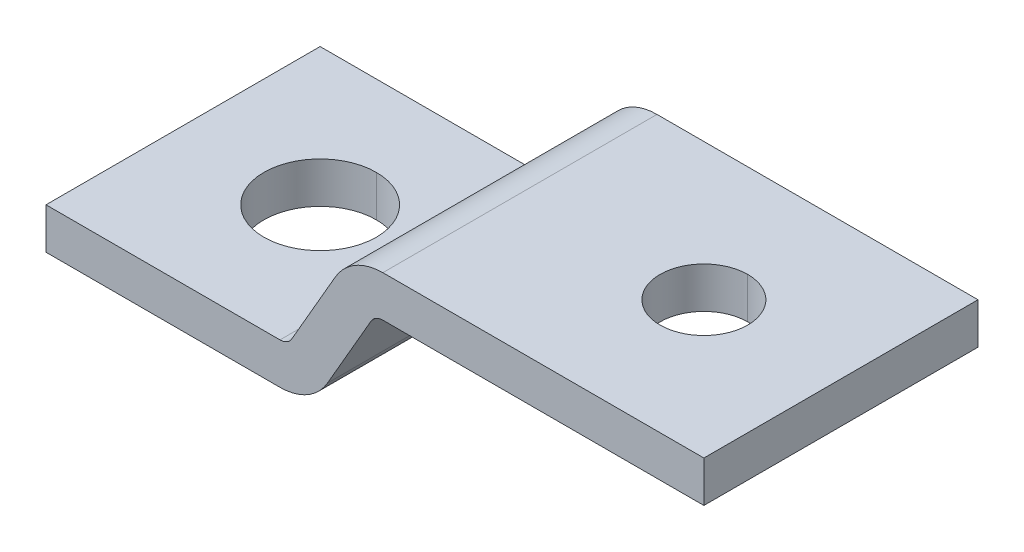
ISO-10303-21;
HEADER;
FILE_DESCRIPTION(('STEP AP214'),'2;1');
FILE_NAME('part.step','',(''),(''),'','','');
FILE_SCHEMA(('AUTOMOTIVE_DESIGN { 1 0 10303 214 1 1 1 1 }'));
ENDSEC;
DATA;
#1=APPLICATION_CONTEXT('core data for automotive mechanical design processes');
#2=APPLICATION_PROTOCOL_DEFINITION('international standard','automotive_design',2000,#1);
#3=PRODUCT_CONTEXT('',#1,'mechanical');
#4=PRODUCT('Part','Part','',(#3));
#5=PRODUCT_RELATED_PRODUCT_CATEGORY('part','',(#4));
#6=PRODUCT_DEFINITION_FORMATION('','',#4);
#7=PRODUCT_DEFINITION_CONTEXT('part definition',#1,'design');
#8=PRODUCT_DEFINITION('design','',#6,#7);
#9=PRODUCT_DEFINITION_SHAPE('','',#8);
#10=(LENGTH_UNIT() NAMED_UNIT(*) SI_UNIT(.MILLI.,.METRE.));
#11=(NAMED_UNIT(*) PLANE_ANGLE_UNIT() SI_UNIT($,.RADIAN.));
#12=(NAMED_UNIT(*) SI_UNIT($,.STERADIAN.) SOLID_ANGLE_UNIT());
#13=UNCERTAINTY_MEASURE_WITH_UNIT(LENGTH_MEASURE(1.E-05),#10,'distance_accuracy_value','');
#14=(GEOMETRIC_REPRESENTATION_CONTEXT(3) GLOBAL_UNCERTAINTY_ASSIGNED_CONTEXT((#13)) GLOBAL_UNIT_ASSIGNED_CONTEXT((#10,
#11,#12)) REPRESENTATION_CONTEXT('',''));
#15=CARTESIAN_POINT('',(0.,0.,0.));
#16=DIRECTION('',(0.,0.,1.));
#17=DIRECTION('',(1.,0.,0.));
#18=AXIS2_PLACEMENT_3D('',#15,#16,#17);
#19=CARTESIAN_POINT('',(2.89110178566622,3.9188977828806,17.2699844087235));
#20=DIRECTION('',(0.,1.,0.));
#21=DIRECTION('',(0.,0.,1.));
#22=AXIS2_PLACEMENT_3D('',#19,#20,#21);
#23=CYLINDRICAL_SURFACE('',#22,2.05);
#24=DIRECTION('',(0.,1.,0.));
#25=VECTOR('',#24,1.);
#26=CARTESIAN_POINT('',(2.89110178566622,3.9188977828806,15.2199844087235));
#27=LINE('',#26,#25);
#28=CARTESIAN_POINT('',(2.89110178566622,9.71717338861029,15.2199844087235));
#29=VERTEX_POINT('',#28);
#30=CARTESIAN_POINT('',(2.89110178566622,11.2171733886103,15.2199844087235));
#31=VERTEX_POINT('',#30);
#32=EDGE_CURVE('E284',#29,#31,#27,.T.);
#33=ORIENTED_EDGE('',*,*,#32,.F.);
#34=CARTESIAN_POINT('',(2.89110178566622,9.71717338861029,17.2699844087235));
#35=DIRECTION('',(0.,1.,0.));
#36=DIRECTION('',(0.,0.,1.));
#37=AXIS2_PLACEMENT_3D('',#34,#35,#36);
#38=CIRCLE('',#37,2.05);
#39=CARTESIAN_POINT('',(2.89110178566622,9.71717338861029,19.3199844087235));
#40=VERTEX_POINT('',#39);
#41=EDGE_CURVE('E169',#40,#29,#38,.T.);
#42=ORIENTED_EDGE('',*,*,#41,.F.);
#43=DIRECTION('',(0.,1.,0.));
#44=VECTOR('',#43,1.);
#45=CARTESIAN_POINT('',(2.89110178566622,3.9188977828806,19.3199844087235));
#46=LINE('',#45,#44);
#47=CARTESIAN_POINT('',(2.89110178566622,11.2171733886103,19.3199844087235));
#48=VERTEX_POINT('',#47);
#49=EDGE_CURVE('E273',#40,#48,#46,.T.);
#50=ORIENTED_EDGE('',*,*,#49,.T.);
#51=CARTESIAN_POINT('',(2.89110178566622,11.2171733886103,17.2699844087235));
#52=DIRECTION('',(0.,1.,0.));
#53=DIRECTION('',(0.,0.,-1.));
#54=AXIS2_PLACEMENT_3D('',#51,#52,#53);
#55=CIRCLE('',#54,2.05);
#56=EDGE_CURVE('E183',#48,#31,#55,.T.);
#57=ORIENTED_EDGE('',*,*,#56,.T.);
#58=EDGE_LOOP('',(#33,#42,#50,#57));
#59=FACE_BOUND('',#58,.T.);
#60=ADVANCED_FACE('F15',(#59),#23,.F.);
#61=CARTESIAN_POINT('',(16.8911017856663,3.9188977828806,17.2699844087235));
#62=DIRECTION('',(0.,1.,0.));
#63=DIRECTION('',(0.,0.,1.));
#64=AXIS2_PLACEMENT_3D('',#61,#62,#63);
#65=CYLINDRICAL_SURFACE('',#64,1.6);
#66=DIRECTION('',(0.,1.,0.));
#67=VECTOR('',#66,1.);
#68=CARTESIAN_POINT('',(16.8911017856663,3.9188977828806,15.6699844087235));
#69=LINE('',#68,#67);
#70=CARTESIAN_POINT('',(16.8911017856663,13.7171733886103,15.6699844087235));
#71=VERTEX_POINT('',#70);
#72=CARTESIAN_POINT('',(16.8911017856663,15.2171733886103,15.6699844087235));
#73=VERTEX_POINT('',#72);
#74=EDGE_CURVE('E265',#71,#73,#69,.T.);
#75=ORIENTED_EDGE('',*,*,#74,.F.);
#76=CARTESIAN_POINT('',(16.8911017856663,13.7171733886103,17.2699844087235));
#77=DIRECTION('',(0.,-1.,0.));
#78=DIRECTION('',(0.,0.,1.));
#79=AXIS2_PLACEMENT_3D('',#76,#77,#78);
#80=CIRCLE('',#79,1.6);
#81=CARTESIAN_POINT('',(16.8911017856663,13.7171733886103,18.8699844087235));
#82=VERTEX_POINT('',#81);
#83=EDGE_CURVE('E203',#71,#82,#80,.T.);
#84=ORIENTED_EDGE('',*,*,#83,.T.);
#85=DIRECTION('',(0.,1.,0.));
#86=VECTOR('',#85,1.);
#87=CARTESIAN_POINT('',(16.8911017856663,3.9188977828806,18.8699844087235));
#88=LINE('',#87,#86);
#89=CARTESIAN_POINT('',(16.8911017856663,15.2171733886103,18.8699844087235));
#90=VERTEX_POINT('',#89);
#91=EDGE_CURVE('E256',#82,#90,#88,.T.);
#92=ORIENTED_EDGE('',*,*,#91,.T.);
#93=CARTESIAN_POINT('',(16.8911017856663,15.2171733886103,17.2699844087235));
#94=DIRECTION('',(0.,-1.,0.));
#95=DIRECTION('',(0.,0.,-1.));
#96=AXIS2_PLACEMENT_3D('',#93,#94,#95);
#97=CIRCLE('',#96,1.6);
#98=EDGE_CURVE('E222',#73,#90,#97,.T.);
#99=ORIENTED_EDGE('',*,*,#98,.F.);
#100=EDGE_LOOP('',(#75,#84,#92,#99));
#101=FACE_BOUND('',#100,.T.);
#102=ADVANCED_FACE('F382',(#101),#65,.F.);
#103=CARTESIAN_POINT('',(10.179776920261,13.2171733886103,22.2699844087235));
#104=DIRECTION('',(0.,0.,-1.));
#105=DIRECTION('',(-1.,0.,0.));
#106=AXIS2_PLACEMENT_3D('',#103,#104,#105);
#107=CYLINDRICAL_SURFACE('',#106,2.);
#108=CARTESIAN_POINT('',(10.179776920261,13.2171733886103,22.2699844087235));
#109=DIRECTION('',(0.,0.,1.));
#110=DIRECTION('',(1.,0.,0.));
#111=AXIS2_PLACEMENT_3D('',#108,#109,#110);
#112=CIRCLE('',#111,2.);
#113=CARTESIAN_POINT('',(10.179776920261,15.2171733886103,22.2699844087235));
#114=VERTEX_POINT('',#113);
#115=CARTESIAN_POINT('',(8.44772611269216,14.2171733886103,22.2699844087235));
#116=VERTEX_POINT('',#115);
#117=EDGE_CURVE('E119',#114,#116,#112,.T.);
#118=ORIENTED_EDGE('',*,*,#117,.F.);
#119=DIRECTION('',(0.,0.,1.));
#120=VECTOR('',#119,1.);
#121=CARTESIAN_POINT('',(10.179776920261,15.2171733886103,22.2699844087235));
#122=LINE('',#121,#120);
#123=CARTESIAN_POINT('',(10.179776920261,15.2171733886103,12.2699844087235));
#124=VERTEX_POINT('',#123);
#125=EDGE_CURVE('E211',#124,#114,#122,.T.);
#126=ORIENTED_EDGE('',*,*,#125,.F.);
#127=CARTESIAN_POINT('',(10.179776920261,13.2171733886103,12.2699844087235));
#128=DIRECTION('',(0.,0.,-1.));
#129=DIRECTION('',(1.,0.,0.));
#130=AXIS2_PLACEMENT_3D('',#127,#128,#129);
#131=CIRCLE('',#130,2.);
#132=CARTESIAN_POINT('',(8.44772611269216,14.2171733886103,12.2699844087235));
#133=VERTEX_POINT('',#132);
#134=EDGE_CURVE('E24',#133,#124,#131,.T.);
#135=ORIENTED_EDGE('',*,*,#134,.F.);
#136=DIRECTION('',(0.,0.,-1.));
#137=VECTOR('',#136,1.);
#138=CARTESIAN_POINT('',(8.44772611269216,14.2171733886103,22.2699844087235));
#139=LINE('',#138,#137);
#140=EDGE_CURVE('E135',#116,#133,#139,.T.);
#141=ORIENTED_EDGE('',*,*,#140,.F.);
#142=EDGE_LOOP('',(#118,#126,#135,#141));
#143=FACE_BOUND('',#142,.T.);
#144=ADVANCED_FACE('F387',(#143),#107,.T.);
#145=CARTESIAN_POINT('',(6.42700017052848,11.7171733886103,22.2699844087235));
#146=DIRECTION('',(0.,0.,-1.));
#147=DIRECTION('',(-1.,0.,0.));
#148=AXIS2_PLACEMENT_3D('',#145,#146,#147);
#149=CYLINDRICAL_SURFACE('',#148,2.);
#150=CARTESIAN_POINT('',(6.42700017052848,11.7171733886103,22.2699844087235));
#151=DIRECTION('',(0.,0.,1.));
#152=DIRECTION('',(1.,0.,0.));
#153=AXIS2_PLACEMENT_3D('',#150,#151,#152);
#154=CIRCLE('',#153,2.);
#155=CARTESIAN_POINT('',(6.42700017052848,9.71717338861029,22.2699844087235));
#156=VERTEX_POINT('',#155);
#157=CARTESIAN_POINT('',(8.15905097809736,10.7171733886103,22.2699844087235));
#158=VERTEX_POINT('',#157);
#159=EDGE_CURVE('E128',#156,#158,#154,.T.);
#160=ORIENTED_EDGE('',*,*,#159,.F.);
#161=DIRECTION('',(0.,0.,1.));
#162=VECTOR('',#161,1.);
#163=CARTESIAN_POINT('',(6.42700017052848,9.71717338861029,22.2699844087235));
#164=LINE('',#163,#162);
#165=CARTESIAN_POINT('',(6.42700017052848,9.71717338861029,12.2699844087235));
#166=VERTEX_POINT('',#165);
#167=EDGE_CURVE('E280',#166,#156,#164,.T.);
#168=ORIENTED_EDGE('',*,*,#167,.F.);
#169=CARTESIAN_POINT('',(6.42700017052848,11.7171733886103,12.2699844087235));
#170=DIRECTION('',(0.,0.,-1.));
#171=DIRECTION('',(1.,0.,0.));
#172=AXIS2_PLACEMENT_3D('',#169,#170,#171);
#173=CIRCLE('',#172,2.);
#174=CARTESIAN_POINT('',(8.15905097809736,10.7171733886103,12.2699844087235));
#175=VERTEX_POINT('',#174);
#176=EDGE_CURVE('E118',#175,#166,#173,.T.);
#177=ORIENTED_EDGE('',*,*,#176,.F.);
#178=DIRECTION('',(0.,0.,-1.));
#179=VECTOR('',#178,1.);
#180=CARTESIAN_POINT('',(8.15905097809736,10.7171733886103,22.2699844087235));
#181=LINE('',#180,#179);
#182=EDGE_CURVE('E238',#158,#175,#181,.T.);
#183=ORIENTED_EDGE('',*,*,#182,.F.);
#184=EDGE_LOOP('',(#160,#168,#177,#183));
#185=FACE_BOUND('',#184,.T.);
#186=ADVANCED_FACE('F363',(#185),#149,.T.);
#187=CARTESIAN_POINT('',(10.179776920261,13.2171733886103,22.2699844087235));
#188=DIRECTION('',(0.,0.,1.));
#189=DIRECTION('',(1.,0.,0.));
#190=AXIS2_PLACEMENT_3D('',#187,#188,#189);
#191=CYLINDRICAL_SURFACE('',#190,0.5);
#192=CARTESIAN_POINT('',(10.179776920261,13.2171733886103,22.2699844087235));
#193=DIRECTION('',(0.,0.,-1.));
#194=DIRECTION('',(1.,0.,0.));
#195=AXIS2_PLACEMENT_3D('',#192,#193,#194);
#196=CIRCLE('',#195,0.5);
#197=CARTESIAN_POINT('',(9.74676421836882,13.4671733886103,22.2699844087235));
#198=VERTEX_POINT('',#197);
#199=CARTESIAN_POINT('',(10.179776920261,13.7171733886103,22.2699844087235));
#200=VERTEX_POINT('',#199);
#201=EDGE_CURVE('E149',#198,#200,#196,.T.);
#202=ORIENTED_EDGE('',*,*,#201,.F.);
#203=DIRECTION('',(0.,0.,1.));
#204=VECTOR('',#203,1.);
#205=CARTESIAN_POINT('',(9.74676421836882,13.4671733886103,22.2699844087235));
#206=LINE('',#205,#204);
#207=CARTESIAN_POINT('',(9.74676421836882,13.4671733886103,12.2699844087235));
#208=VERTEX_POINT('',#207);
#209=EDGE_CURVE('E245',#208,#198,#206,.T.);
#210=ORIENTED_EDGE('',*,*,#209,.F.);
#211=CARTESIAN_POINT('',(10.179776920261,13.2171733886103,12.2699844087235));
#212=DIRECTION('',(0.,0.,1.));
#213=DIRECTION('',(1.,0.,0.));
#214=AXIS2_PLACEMENT_3D('',#211,#212,#213);
#215=CIRCLE('',#214,0.5);
#216=CARTESIAN_POINT('',(10.179776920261,13.7171733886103,12.2699844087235));
#217=VERTEX_POINT('',#216);
#218=EDGE_CURVE('E10',#217,#208,#215,.T.);
#219=ORIENTED_EDGE('',*,*,#218,.F.);
#220=DIRECTION('',(0.,0.,-1.));
#221=VECTOR('',#220,1.);
#222=CARTESIAN_POINT('',(10.179776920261,13.7171733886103,12.2699844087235));
#223=LINE('',#222,#221);
#224=EDGE_CURVE('E191',#200,#217,#223,.T.);
#225=ORIENTED_EDGE('',*,*,#224,.F.);
#226=EDGE_LOOP('',(#202,#210,#219,#225));
#227=FACE_BOUND('',#226,.T.);
#228=ADVANCED_FACE('F401',(#227),#191,.F.);
#229=CARTESIAN_POINT('',(6.42700017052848,11.7171733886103,22.2699844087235));
#230=DIRECTION('',(0.,0.,1.));
#231=DIRECTION('',(1.,0.,0.));
#232=AXIS2_PLACEMENT_3D('',#229,#230,#231);
#233=CYLINDRICAL_SURFACE('',#232,0.5);
#234=CARTESIAN_POINT('',(6.42700017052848,11.7171733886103,22.2699844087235));
#235=DIRECTION('',(0.,0.,-1.));
#236=DIRECTION('',(1.,0.,0.));
#237=AXIS2_PLACEMENT_3D('',#234,#235,#236);
#238=CIRCLE('',#237,0.5);
#239=CARTESIAN_POINT('',(6.8600128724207,11.4671733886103,22.2699844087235));
#240=VERTEX_POINT('',#239);
#241=CARTESIAN_POINT('',(6.42700017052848,11.2171733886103,22.2699844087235));
#242=VERTEX_POINT('',#241);
#243=EDGE_CURVE('E106',#240,#242,#238,.T.);
#244=ORIENTED_EDGE('',*,*,#243,.F.);
#245=DIRECTION('',(0.,0.,1.));
#246=VECTOR('',#245,1.);
#247=CARTESIAN_POINT('',(6.8600128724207,11.4671733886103,22.2699844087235));
#248=LINE('',#247,#246);
#249=CARTESIAN_POINT('',(6.8600128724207,11.4671733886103,12.2699844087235));
#250=VERTEX_POINT('',#249);
#251=EDGE_CURVE('E109',#250,#240,#248,.T.);
#252=ORIENTED_EDGE('',*,*,#251,.F.);
#253=CARTESIAN_POINT('',(6.42700017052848,11.7171733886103,12.2699844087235));
#254=DIRECTION('',(0.,0.,1.));
#255=DIRECTION('',(1.,0.,0.));
#256=AXIS2_PLACEMENT_3D('',#253,#254,#255);
#257=CIRCLE('',#256,0.5);
#258=CARTESIAN_POINT('',(6.42700017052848,11.2171733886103,12.2699844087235));
#259=VERTEX_POINT('',#258);
#260=EDGE_CURVE('E35',#259,#250,#257,.T.);
#261=ORIENTED_EDGE('',*,*,#260,.F.);
#262=DIRECTION('',(0.,0.,-1.));
#263=VECTOR('',#262,1.);
#264=CARTESIAN_POINT('',(6.42700017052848,11.2171733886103,12.2699844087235));
#265=LINE('',#264,#263);
#266=EDGE_CURVE('E112',#242,#259,#265,.T.);
#267=ORIENTED_EDGE('',*,*,#266,.F.);
#268=EDGE_LOOP('',(#244,#252,#261,#267));
#269=FACE_BOUND('',#268,.T.);
#270=ADVANCED_FACE('F108',(#269),#233,.F.);
#271=CARTESIAN_POINT('',(-2.10889821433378,11.2171733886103,12.2699844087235));
#272=DIRECTION('',(0.,0.,1.));
#273=DIRECTION('',(1.,0.,0.));
#274=AXIS2_PLACEMENT_3D('',#271,#272,#273);
#275=PLANE('',#274);
#276=DIRECTION('',(0.5,0.86602540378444,0.));
#277=VECTOR('',#276,1.);
#278=CARTESIAN_POINT('',(7.58170070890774,9.71717338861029,12.2699844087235));
#279=LINE('',#278,#277);
#280=EDGE_CURVE('E242',#175,#208,#279,.T.);
#281=ORIENTED_EDGE('',*,*,#280,.F.);
#282=ORIENTED_EDGE('',*,*,#176,.T.);
#283=DIRECTION('',(1.,0.,0.));
#284=VECTOR('',#283,1.);
#285=CARTESIAN_POINT('',(-2.10889821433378,9.71717338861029,12.2699844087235));
#286=LINE('',#285,#284);
#287=CARTESIAN_POINT('',(-2.10889821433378,9.71717338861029,12.2699844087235));
#288=VERTEX_POINT('',#287);
#289=EDGE_CURVE('E165',#288,#166,#286,.T.);
#290=ORIENTED_EDGE('',*,*,#289,.F.);
#291=DIRECTION('',(0.,-1.,0.));
#292=VECTOR('',#291,1.);
#293=CARTESIAN_POINT('',(-2.10889821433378,11.2171733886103,12.2699844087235));
#294=LINE('',#293,#292);
#295=CARTESIAN_POINT('',(-2.10889821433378,11.2171733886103,12.2699844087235));
#296=VERTEX_POINT('',#295);
#297=EDGE_CURVE('E226',#296,#288,#294,.T.);
#298=ORIENTED_EDGE('',*,*,#297,.F.);
#299=DIRECTION('',(-1.,0.,0.));
#300=VECTOR('',#299,1.);
#301=CARTESIAN_POINT('',(-2.10889821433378,11.2171733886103,12.2699844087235));
#302=LINE('',#301,#300);
#303=EDGE_CURVE('E175',#259,#296,#302,.T.);
#304=ORIENTED_EDGE('',*,*,#303,.F.);
#305=ORIENTED_EDGE('',*,*,#260,.T.);
#306=DIRECTION('',(-0.5,-0.86602540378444,0.));
#307=VECTOR('',#306,1.);
#308=CARTESIAN_POINT('',(6.71567530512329,11.2171733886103,12.2699844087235));
#309=LINE('',#308,#307);
#310=EDGE_CURVE('E126',#133,#250,#309,.T.);
#311=ORIENTED_EDGE('',*,*,#310,.F.);
#312=ORIENTED_EDGE('',*,*,#134,.T.);
#313=DIRECTION('',(-1.,0.,0.));
#314=VECTOR('',#313,1.);
#315=CARTESIAN_POINT('',(9.02507638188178,15.2171733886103,12.2699844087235));
#316=LINE('',#315,#314);
#317=CARTESIAN_POINT('',(21.8911017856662,15.2171733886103,12.2699844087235));
#318=VERTEX_POINT('',#317);
#319=EDGE_CURVE('E207',#318,#124,#316,.T.);
#320=ORIENTED_EDGE('',*,*,#319,.F.);
#321=DIRECTION('',(0.,1.,0.));
#322=VECTOR('',#321,1.);
#323=CARTESIAN_POINT('',(21.8911017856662,13.7171733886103,12.2699844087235));
#324=LINE('',#323,#322);
#325=CARTESIAN_POINT('',(21.8911017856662,13.7171733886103,12.2699844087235));
#326=VERTEX_POINT('',#325);
#327=EDGE_CURVE('E142',#326,#318,#324,.T.);
#328=ORIENTED_EDGE('',*,*,#327,.F.);
#329=DIRECTION('',(1.,0.,0.));
#330=VECTOR('',#329,1.);
#331=CARTESIAN_POINT('',(9.89110178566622,13.7171733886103,12.2699844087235));
#332=LINE('',#331,#330);
#333=EDGE_CURVE('E195',#217,#326,#332,.T.);
#334=ORIENTED_EDGE('',*,*,#333,.F.);
#335=ORIENTED_EDGE('',*,*,#218,.T.);
#336=EDGE_LOOP('',(#281,#282,#290,#298,#304,#305,#311,#312,#320,#328,#334,#335));
#337=FACE_BOUND('',#336,.T.);
#338=ADVANCED_FACE('F357',(#337),#275,.F.);
#339=CARTESIAN_POINT('',(-2.10889821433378,11.2171733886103,22.2699844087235));
#340=DIRECTION('',(0.,0.,1.));
#341=DIRECTION('',(1.,0.,0.));
#342=AXIS2_PLACEMENT_3D('',#339,#340,#341);
#343=PLANE('',#342);
#344=DIRECTION('',(1.,0.,0.));
#345=VECTOR('',#344,1.);
#346=CARTESIAN_POINT('',(-2.10889821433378,9.71717338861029,22.2699844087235));
#347=LINE('',#346,#345);
#348=CARTESIAN_POINT('',(-2.10889821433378,9.71717338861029,22.2699844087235));
#349=VERTEX_POINT('',#348);
#350=EDGE_CURVE('E170',#349,#156,#347,.T.);
#351=ORIENTED_EDGE('',*,*,#350,.T.);
#352=ORIENTED_EDGE('',*,*,#159,.T.);
#353=DIRECTION('',(0.5,0.86602540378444,0.));
#354=VECTOR('',#353,1.);
#355=CARTESIAN_POINT('',(7.58170070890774,9.71717338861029,22.2699844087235));
#356=LINE('',#355,#354);
#357=EDGE_CURVE('E234',#158,#198,#356,.T.);
#358=ORIENTED_EDGE('',*,*,#357,.T.);
#359=ORIENTED_EDGE('',*,*,#201,.T.);
#360=DIRECTION('',(1.,0.,0.));
#361=VECTOR('',#360,1.);
#362=CARTESIAN_POINT('',(9.89110178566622,13.7171733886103,22.2699844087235));
#363=LINE('',#362,#361);
#364=CARTESIAN_POINT('',(21.8911017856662,13.7171733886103,22.2699844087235));
#365=VERTEX_POINT('',#364);
#366=EDGE_CURVE('E187',#200,#365,#363,.T.);
#367=ORIENTED_EDGE('',*,*,#366,.T.);
#368=DIRECTION('',(0.,1.,0.));
#369=VECTOR('',#368,1.);
#370=CARTESIAN_POINT('',(21.8911017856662,13.7171733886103,22.2699844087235));
#371=LINE('',#370,#369);
#372=CARTESIAN_POINT('',(21.8911017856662,15.2171733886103,22.2699844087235));
#373=VERTEX_POINT('',#372);
#374=EDGE_CURVE('E136',#365,#373,#371,.T.);
#375=ORIENTED_EDGE('',*,*,#374,.T.);
#376=DIRECTION('',(-1.,0.,0.));
#377=VECTOR('',#376,1.);
#378=CARTESIAN_POINT('',(9.02507638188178,15.2171733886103,22.2699844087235));
#379=LINE('',#378,#377);
#380=EDGE_CURVE('E215',#373,#114,#379,.T.);
#381=ORIENTED_EDGE('',*,*,#380,.T.);
#382=ORIENTED_EDGE('',*,*,#117,.T.);
#383=DIRECTION('',(-0.5,-0.86602540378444,0.));
#384=VECTOR('',#383,1.);
#385=CARTESIAN_POINT('',(6.71567530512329,11.2171733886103,22.2699844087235));
#386=LINE('',#385,#384);
#387=EDGE_CURVE('E125',#116,#240,#386,.T.);
#388=ORIENTED_EDGE('',*,*,#387,.T.);
#389=ORIENTED_EDGE('',*,*,#243,.T.);
#390=DIRECTION('',(-1.,0.,0.));
#391=VECTOR('',#390,1.);
#392=CARTESIAN_POINT('',(-2.10889821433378,11.2171733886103,22.2699844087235));
#393=LINE('',#392,#391);
#394=CARTESIAN_POINT('',(-2.10889821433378,11.2171733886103,22.2699844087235));
#395=VERTEX_POINT('',#394);
#396=EDGE_CURVE('E172',#242,#395,#393,.T.);
#397=ORIENTED_EDGE('',*,*,#396,.T.);
#398=DIRECTION('',(0.,-1.,0.));
#399=VECTOR('',#398,1.);
#400=CARTESIAN_POINT('',(-2.10889821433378,11.2171733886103,22.2699844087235));
#401=LINE('',#400,#399);
#402=EDGE_CURVE('E230',#395,#349,#401,.T.);
#403=ORIENTED_EDGE('',*,*,#402,.T.);
#404=EDGE_LOOP('',(#351,#352,#358,#359,#367,#375,#381,#382,#388,#389,#397,#403));
#405=FACE_BOUND('',#404,.T.);
#406=ADVANCED_FACE('F131',(#405),#343,.T.);
#407=CARTESIAN_POINT('',(6.71567530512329,11.2171733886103,22.2699844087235));
#408=DIRECTION('',(0.86602540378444,-0.5,0.));
#409=DIRECTION('',(0.,0.,-1.));
#410=AXIS2_PLACEMENT_3D('',#407,#408,#409);
#411=PLANE('',#410);
#412=ORIENTED_EDGE('',*,*,#387,.F.);
#413=ORIENTED_EDGE('',*,*,#140,.T.);
#414=ORIENTED_EDGE('',*,*,#310,.T.);
#415=ORIENTED_EDGE('',*,*,#251,.T.);
#416=EDGE_LOOP('',(#412,#413,#414,#415));
#417=FACE_BOUND('',#416,.T.);
#418=ADVANCED_FACE('F123',(#417),#411,.F.);
#419=CARTESIAN_POINT('',(21.8911017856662,13.7171733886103,22.2699844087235));
#420=DIRECTION('',(-1.,0.,0.));
#421=DIRECTION('',(0.,0.,1.));
#422=AXIS2_PLACEMENT_3D('',#419,#420,#421);
#423=PLANE('',#422);
#424=ORIENTED_EDGE('',*,*,#327,.T.);
#425=DIRECTION('',(0.,0.,-1.));
#426=VECTOR('',#425,1.);
#427=CARTESIAN_POINT('',(21.8911017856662,15.2171733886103,22.2699844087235));
#428=LINE('',#427,#426);
#429=EDGE_CURVE('E218',#373,#318,#428,.T.);
#430=ORIENTED_EDGE('',*,*,#429,.F.);
#431=ORIENTED_EDGE('',*,*,#374,.F.);
#432=DIRECTION('',(0.,0.,-1.));
#433=VECTOR('',#432,1.);
#434=CARTESIAN_POINT('',(21.8911017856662,13.7171733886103,22.2699844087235));
#435=LINE('',#434,#433);
#436=EDGE_CURVE('E199',#365,#326,#435,.T.);
#437=ORIENTED_EDGE('',*,*,#436,.T.);
#438=EDGE_LOOP('',(#424,#430,#431,#437));
#439=FACE_BOUND('',#438,.T.);
#440=ADVANCED_FACE('F404',(#439),#423,.F.);
#441=CARTESIAN_POINT('',(7.58170070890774,9.71717338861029,22.2699844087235));
#442=DIRECTION('',(-0.86602540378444,0.5,0.));
#443=DIRECTION('',(0.,0.,1.));
#444=AXIS2_PLACEMENT_3D('',#441,#442,#443);
#445=PLANE('',#444);
#446=ORIENTED_EDGE('',*,*,#357,.F.);
#447=ORIENTED_EDGE('',*,*,#182,.T.);
#448=ORIENTED_EDGE('',*,*,#280,.T.);
#449=ORIENTED_EDGE('',*,*,#209,.T.);
#450=EDGE_LOOP('',(#446,#447,#448,#449));
#451=FACE_BOUND('',#450,.T.);
#452=ADVANCED_FACE('F410',(#451),#445,.F.);
#453=CARTESIAN_POINT('',(-2.10889821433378,11.2171733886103,22.2699844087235));
#454=DIRECTION('',(1.,0.,0.));
#455=DIRECTION('',(0.,1.,0.));
#456=AXIS2_PLACEMENT_3D('',#453,#454,#455);
#457=PLANE('',#456);
#458=ORIENTED_EDGE('',*,*,#297,.T.);
#459=DIRECTION('',(0.,0.,-1.));
#460=VECTOR('',#459,1.);
#461=CARTESIAN_POINT('',(-2.10889821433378,9.71717338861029,22.2699844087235));
#462=LINE('',#461,#460);
#463=EDGE_CURVE('E167',#349,#288,#462,.T.);
#464=ORIENTED_EDGE('',*,*,#463,.F.);
#465=ORIENTED_EDGE('',*,*,#402,.F.);
#466=DIRECTION('',(0.,0.,-1.));
#467=VECTOR('',#466,1.);
#468=CARTESIAN_POINT('',(-2.10889821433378,11.2171733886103,22.2699844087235));
#469=LINE('',#468,#467);
#470=EDGE_CURVE('E179',#395,#296,#469,.T.);
#471=ORIENTED_EDGE('',*,*,#470,.T.);
#472=EDGE_LOOP('',(#458,#464,#465,#471));
#473=FACE_BOUND('',#472,.T.);
#474=ADVANCED_FACE('F351',(#473),#457,.F.);
#475=CARTESIAN_POINT('',(9.02507638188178,15.2171733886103,22.2699844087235));
#476=DIRECTION('',(0.,-1.,0.));
#477=DIRECTION('',(0.,0.,-1.));
#478=AXIS2_PLACEMENT_3D('',#475,#476,#477);
#479=PLANE('',#478);
#480=CARTESIAN_POINT('',(16.8911017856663,15.2171733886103,17.2699844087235));
#481=DIRECTION('',(0.,-1.,0.));
#482=DIRECTION('',(0.,0.,-1.));
#483=AXIS2_PLACEMENT_3D('',#480,#481,#482);
#484=CIRCLE('',#483,1.6);
#485=EDGE_CURVE('E259',#90,#73,#484,.T.);
#486=ORIENTED_EDGE('',*,*,#485,.T.);
#487=ORIENTED_EDGE('',*,*,#98,.T.);
#488=EDGE_LOOP('',(#486,#487));
#489=FACE_BOUND('',#488,.T.);
#490=ORIENTED_EDGE('',*,*,#319,.T.);
#491=ORIENTED_EDGE('',*,*,#125,.T.);
#492=ORIENTED_EDGE('',*,*,#380,.F.);
#493=ORIENTED_EDGE('',*,*,#429,.T.);
#494=EDGE_LOOP('',(#490,#491,#492,#493));
#495=FACE_BOUND('',#494,.T.);
#496=ADVANCED_FACE('F377',(#489,#495),#479,.F.);
#497=CARTESIAN_POINT('',(9.89110178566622,13.7171733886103,22.2699844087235));
#498=DIRECTION('',(0.,1.,0.));
#499=DIRECTION('',(1.,0.,0.));
#500=AXIS2_PLACEMENT_3D('',#497,#498,#499);
#501=PLANE('',#500);
#502=CARTESIAN_POINT('',(16.8911017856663,13.7171733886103,17.2699844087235));
#503=DIRECTION('',(0.,-1.,0.));
#504=DIRECTION('',(0.,0.,1.));
#505=AXIS2_PLACEMENT_3D('',#502,#503,#504);
#506=CIRCLE('',#505,1.6);
#507=EDGE_CURVE('E269',#82,#71,#506,.T.);
#508=ORIENTED_EDGE('',*,*,#507,.F.);
#509=ORIENTED_EDGE('',*,*,#83,.F.);
#510=EDGE_LOOP('',(#508,#509));
#511=FACE_BOUND('',#510,.T.);
#512=ORIENTED_EDGE('',*,*,#366,.F.);
#513=ORIENTED_EDGE('',*,*,#224,.T.);
#514=ORIENTED_EDGE('',*,*,#333,.T.);
#515=ORIENTED_EDGE('',*,*,#436,.F.);
#516=EDGE_LOOP('',(#512,#513,#514,#515));
#517=FACE_BOUND('',#516,.T.);
#518=ADVANCED_FACE('F367',(#511,#517),#501,.F.);
#519=CARTESIAN_POINT('',(-2.10889821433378,11.2171733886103,22.2699844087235));
#520=DIRECTION('',(0.,-1.,0.));
#521=DIRECTION('',(0.,0.,-1.));
#522=AXIS2_PLACEMENT_3D('',#519,#520,#521);
#523=PLANE('',#522);
#524=ORIENTED_EDGE('',*,*,#56,.F.);
#525=CARTESIAN_POINT('',(2.89110178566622,11.2171733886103,17.2699844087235));
#526=DIRECTION('',(0.,1.,0.));
#527=DIRECTION('',(0.,0.,-1.));
#528=AXIS2_PLACEMENT_3D('',#525,#526,#527);
#529=CIRCLE('',#528,2.05);
#530=EDGE_CURVE('E277',#31,#48,#529,.T.);
#531=ORIENTED_EDGE('',*,*,#530,.F.);
#532=EDGE_LOOP('',(#524,#531));
#533=FACE_BOUND('',#532,.T.);
#534=ORIENTED_EDGE('',*,*,#396,.F.);
#535=ORIENTED_EDGE('',*,*,#266,.T.);
#536=ORIENTED_EDGE('',*,*,#303,.T.);
#537=ORIENTED_EDGE('',*,*,#470,.F.);
#538=EDGE_LOOP('',(#534,#535,#536,#537));
#539=FACE_BOUND('',#538,.T.);
#540=ADVANCED_FACE('F365',(#533,#539),#523,.F.);
#541=CARTESIAN_POINT('',(-2.10889821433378,9.71717338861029,22.2699844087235));
#542=DIRECTION('',(0.,1.,0.));
#543=DIRECTION('',(1.,0.,0.));
#544=AXIS2_PLACEMENT_3D('',#541,#542,#543);
#545=PLANE('',#544);
#546=ORIENTED_EDGE('',*,*,#41,.T.);
#547=CARTESIAN_POINT('',(2.89110178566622,9.71717338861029,17.2699844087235));
#548=DIRECTION('',(0.,1.,0.));
#549=DIRECTION('',(0.,0.,1.));
#550=AXIS2_PLACEMENT_3D('',#547,#548,#549);
#551=CIRCLE('',#550,2.05);
#552=EDGE_CURVE('E291',#29,#40,#551,.T.);
#553=ORIENTED_EDGE('',*,*,#552,.T.);
#554=EDGE_LOOP('',(#546,#553));
#555=FACE_BOUND('',#554,.T.);
#556=ORIENTED_EDGE('',*,*,#289,.T.);
#557=ORIENTED_EDGE('',*,*,#167,.T.);
#558=ORIENTED_EDGE('',*,*,#350,.F.);
#559=ORIENTED_EDGE('',*,*,#463,.T.);
#560=EDGE_LOOP('',(#556,#557,#558,#559));
#561=FACE_BOUND('',#560,.T.);
#562=ADVANCED_FACE('F300',(#555,#561),#545,.F.);
#563=CARTESIAN_POINT('',(16.8911017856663,3.9188977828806,17.2699844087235));
#564=DIRECTION('',(0.,1.,0.));
#565=DIRECTION('',(0.,0.,1.));
#566=AXIS2_PLACEMENT_3D('',#563,#564,#565);
#567=CYLINDRICAL_SURFACE('',#566,1.6);
#568=ORIENTED_EDGE('',*,*,#507,.T.);
#569=ORIENTED_EDGE('',*,*,#74,.T.);
#570=ORIENTED_EDGE('',*,*,#485,.F.);
#571=ORIENTED_EDGE('',*,*,#91,.F.);
#572=EDGE_LOOP('',(#568,#569,#570,#571));
#573=FACE_BOUND('',#572,.T.);
#574=ADVANCED_FACE('F375',(#573),#567,.F.);
#575=CARTESIAN_POINT('',(2.89110178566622,3.9188977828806,17.2699844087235));
#576=DIRECTION('',(0.,1.,0.));
#577=DIRECTION('',(0.,0.,1.));
#578=AXIS2_PLACEMENT_3D('',#575,#576,#577);
#579=CYLINDRICAL_SURFACE('',#578,2.05);
#580=ORIENTED_EDGE('',*,*,#552,.F.);
#581=ORIENTED_EDGE('',*,*,#32,.T.);
#582=ORIENTED_EDGE('',*,*,#530,.T.);
#583=ORIENTED_EDGE('',*,*,#49,.F.);
#584=EDGE_LOOP('',(#580,#581,#582,#583));
#585=FACE_BOUND('',#584,.T.);
#586=ADVANCED_FACE('F310',(#585),#579,.F.);
#587=CLOSED_SHELL('',(#60,#102,#144,#186,#228,#270,#338,#406,#418,#440,#452,#474,#496,#518,#540,
#562,#574,#586));
#588=MANIFOLD_SOLID_BREP('B1',#587);
#589=ADVANCED_BREP_SHAPE_REPRESENTATION('',(#18,#588),#14);
#590=SHAPE_DEFINITION_REPRESENTATION(#9,#589);
ENDSEC;
END-ISO-10303-21;
